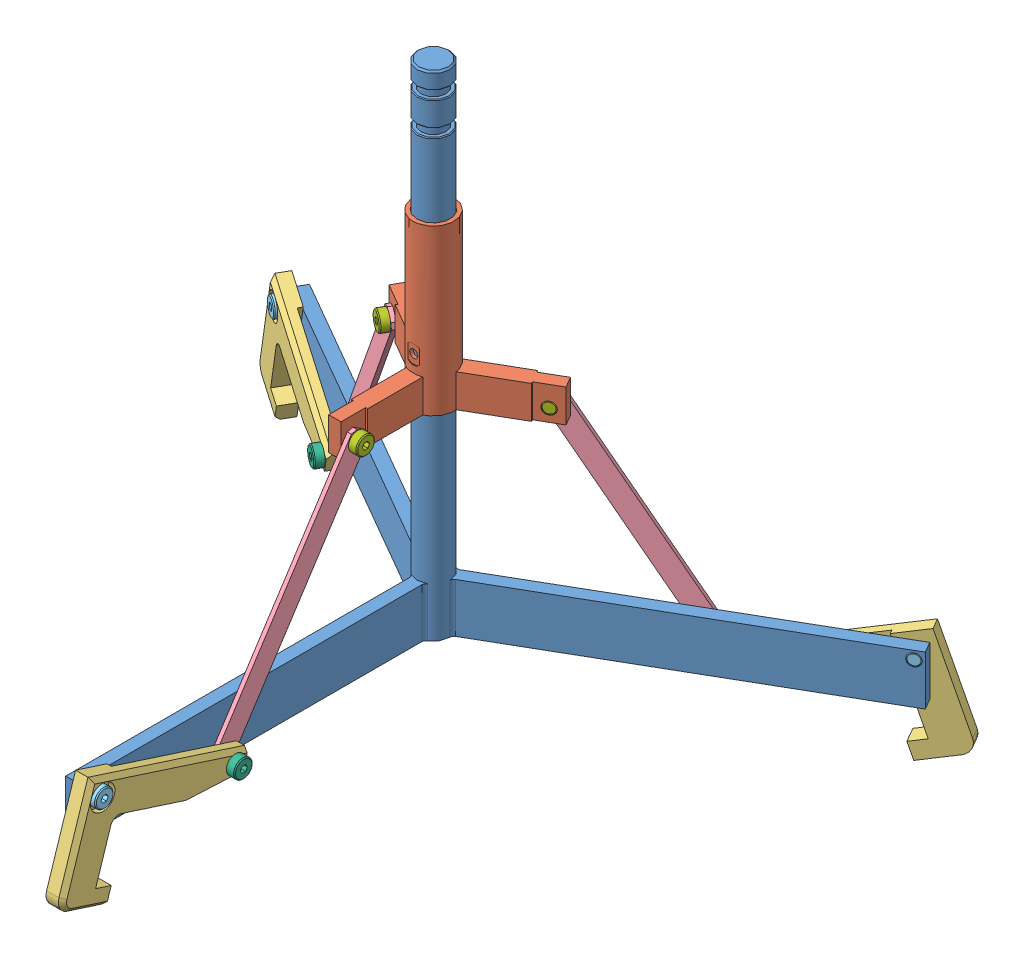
SolidWorks assembly Claw-Mechanism.sldasm, configuration Default (file format 8000). Lengths in mm.
Overall size (537.4 450.84 475.02).
17 component instances, 7 part files, 12 mates.
Components (placement in the parent):
- Center-Post-1: Center-Post.sldprt [Default] at (243.2769 -145.5931 -226.6708) size (488.7 381 423.22)
- Collar-1: Collar.sldprt [Default] at (243.2769 7.2865 -226.6708) size (136.74 127 118.42)
- Claw-1: Claw.sldprt [Default] at (260.7394 -113.8431 46.3792) x (0 0.307291 0.951615) z (-1 0 0) size (127 82.55 12.7)
- Connecting-Rod-1: Connecting-Rod.sldprt [Default] at (251.4684 17.8182 -170.1107) x (0 -0.838902 0.544283) z (-1 0 0) size (203.2 15.88 3.17)
- Pin-Long-1: Pin-Long.sldprt [Default] at (255.9642 -113.8431 46.3792) x (0 -1 0) z (0 0 1) size (14.27 23.8 14.27)
- Pin-Short-1: Pin-Short.sldprt [Default] at (260.7394 -142.9993 -56.3099) x (0 -1 0) z (0 0 1) size (14.27 18.8 14.27)
- Pin-Medium-1: Pin-Medium.sldprt [Default] at (251.4684 16.8115 -159.9958) x (0 -1 0) z (0 0 1) size (14.27 19.3 14.27)
- Claw-2: Claw.sldprt [Default] at (-1.9226 -113.8431 -348.0728) x (-0.824123 0.307291 -0.475808) z (0.5 0 -0.866025) size (127 82.55 12.7)
- Claw-3: Claw.sldprt [Default] at (471.0139 -113.8431 -378.3187) x (0.824123 0.307291 -0.475808) z (0.5 0 0.866025) size (127 82.55 12.7)
- Pin-Medium-2: Pin-Medium.sldprt [Default] at (181.4389 16.8115 -252.9142) x (0 -1 0) z (-0.866025 0 -0.5) size (14.27 19.3 14.27)
- Pin-Medium-3: Pin-Medium.sldprt [Default] at (296.9234 16.8115 -267.1023) x (0 -1 0) z (0.866025 0 -0.5) size (14.27 19.3 14.27)
- Pin-Short-2: Pin-Short.sldprt [Default] at (87.0088 -142.9993 -296.7282) x (0 -1 0) z (-0.866025 0 -0.5) size (14.27 18.8 14.27)
- Pin-Short-3: Pin-Short.sldprt [Default] at (382.0825 -142.9993 -326.9742) x (0 -1 0) z (0.866025 0 -0.5) size (14.27 18.8 14.27)
- Pin-Long-2: Pin-Long.sldprt [Default] at (0.465 -113.8431 -352.2082) x (0 -1 0) z (-0.866025 0 -0.5) size (14.27 23.8 14.27)
- Pin-Long-3: Pin-Long.sldprt [Default] at (473.4015 -113.8431 -374.1833) x (0 -1 0) z (0.866025 0 -0.5) size (14.27 23.8 14.27)
- Connecting-Rod-2: Connecting-Rod.sldprt [Default] at (190.1987 17.8182 -247.8567) x (-0.471363 -0.838902 -0.272141) z (0.5 0 -0.866025) size (203.2 15.88 3.17)
- Connecting-Rod-3: Connecting-Rod.sldprt [Default] at (288.1636 17.8182 -262.0448) x (0.471363 -0.838902 -0.272141) z (0.5 0 0.866025) size (203.2 15.88 3.17)
Mates (geometry in assembly coordinates):
- Concentric11: concentric aligned: cylinder of Center-Post-1 through (243.2769 235.4069 -226.6708) axis (0 -1 0) radius 12.7; cylinder of Collar-1 through (243.2769 134.2865 -226.6708) axis (0 -1 0) radius 15.875
- Concentric21: concentric aligned: cylinder of Center-Post-1 through (255.9769 -113.8431 46.3792) axis (-1 0 0) radius 4.7625; cylinder of Claw-1 through (260.7394 -113.8431 46.3792) axis (-1 0 0) radius 4.7625
- Coincident11: coincident anti-aligned: plane of Center-Post-1 through (248.0394 -145.5931 52.7292) normal (1 0 0); plane of Claw-1 through (248.0394 -122.026 62.3674) normal (-1 0 0)
- Concentric31: concentric aligned: cylinder of Claw-1 through (260.7394 -142.9993 -56.3099) axis (-1 0 0) radius 4.7625; cylinder of Connecting-Rod-1 through (251.4684 -142.9993 -56.3099) axis (-1 0 0) radius 4.7625
- Coincident21: coincident anti-aligned: plane of Claw-1 through (251.4684 -129.8312 38.1963) normal (-1 0 0); plane of Connecting-Rod-1 through (251.4684 17.8182 -170.1107) normal (1 0 0)
- Concentric4: concentric anti-aligned: cylinder of Collar-1 through (227.4019 16.8115 -159.9958) axis (1 0 0) radius 4.7625; cylinder of Connecting-Rod-1 through (251.4684 16.8115 -159.9958) axis (-1 0 0) radius 4.7625
- Concentric51: concentric anti-aligned: cylinder of Claw-1 through (255.9642 -113.8431 46.3792) axis (1 0 0) radius 9.525; cylinder of Pin-Long-1 through (255.9642 -113.8431 46.3792) axis (-1 0 0) radius 4.7371
- Coincident31: coincident anti-aligned: plane of Claw-1 through (255.9642 -113.8431 46.3792) normal (1 0 0); plane of Pin-Long-1 through (255.9642 -113.8431 46.3792) normal (-1 0 0)
- Concentric61: concentric aligned: cylinder of Claw-1 through (260.7394 -142.9993 -56.3099) axis (-1 0 0) radius 4.7625; cylinder of Pin-Short-1 through (260.7394 -142.9993 -56.3099) axis (-1 0 0) radius 4.7371
- Coincident41: coincident anti-aligned: plane of Claw-1 through (260.7394 -122.026 62.3674) normal (1 0 0); plane of Pin-Short-1 through (260.7394 -142.9993 -56.3099) normal (-1 0 0)
- Concentric71: concentric aligned: cylinder of Connecting-Rod-1 through (251.4684 16.8115 -159.9958) axis (-1 0 0) radius 4.7625; cylinder of Pin-Medium-1 through (251.4684 16.8115 -159.9958) axis (-1 0 0) radius 4.7371
- Coincident51: coincident anti-aligned: plane of Connecting-Rod-1 through (251.4684 17.8182 -170.1107) normal (1 0 0); plane of Pin-Medium-1 through (251.4684 16.8115 -159.9958) normal (-1 0 0)
